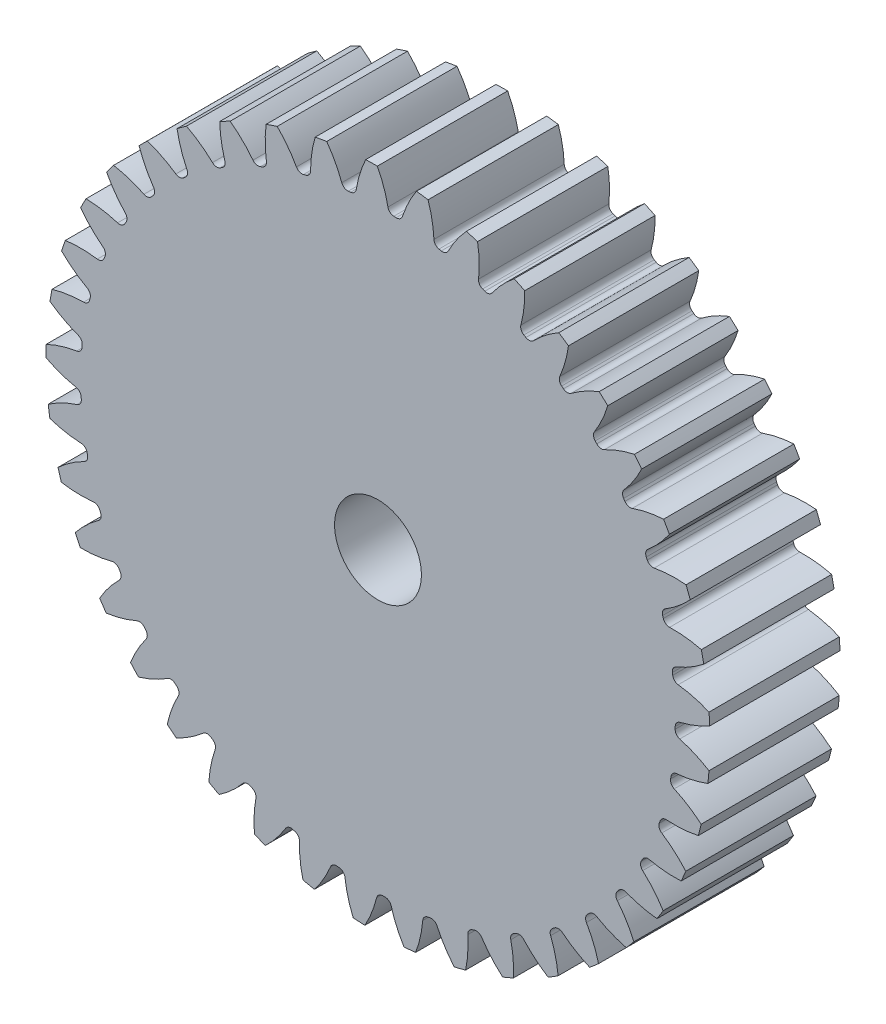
from build123d import *

# Parameters (mm, degrees)
SKETCH3_R         = 242.711111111
GEARBODY_DEPTH    = 95.25
TOOTHCUT_DEPTH    = 357.216127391
CIRPATTERN1_COUNT = 41
BOREDIA_R         = 31.75
BORE_DEPTH        = 12700


with BuildPart() as part:
    # Sketch3 → gearBody (new body)
    with BuildSketch(Plane.XY):
        Circle(SKETCH3_R)
    extrude(amount=GEARBODY_DEPTH)

    # Sketch2 → toothCut (cut, through all)
    with BuildSketch(Plane.XY):
        with BuildLine():
            ThreePointArc((217.254793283, -4.947100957), (217.272623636, -4.089746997), (217.287070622, -3.232329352))
            ThreePointArc((217.287070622, -3.232329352), (218.291107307, -0.433300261), (220.798943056, 1.164640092))
            ThreePointArc((220.798943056, 1.164640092), (232.06007586, 4.744669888), (242.711111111, 9.861814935))
            ThreePointArc((242.711111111, 9.861814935), (242.868359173, -4.571538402), (242.168053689, -18.988749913))
            ThreePointArc((242.168053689, -18.988749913), (231.717136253, -13.47440044), (220.598707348, -9.473117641))
            ThreePointArc((220.598707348, -9.473117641), (218.152783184, -7.781932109), (217.254793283, -4.947100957))
        make_face()
    toothcut = extrude(amount=TOOTHCUT_DEPTH, mode=Mode.SUBTRACT)

    # CirPattern1: toothCut ×41 about axis
    cirpattern1_axis = Axis((0, 0, 0), (0, 0, 1))
    for i in range(1, CIRPATTERN1_COUNT):
        add(toothcut.rotate(cirpattern1_axis, i * 360 / CIRPATTERN1_COUNT), mode=Mode.SUBTRACT)

    # boreDia → bore (cut, symmetric)
    with BuildSketch(Plane.XY):
        Circle(BOREDIA_R)
    extrude(amount=BORE_DEPTH, both=True, mode=Mode.SUBTRACT)


solid = part.part
